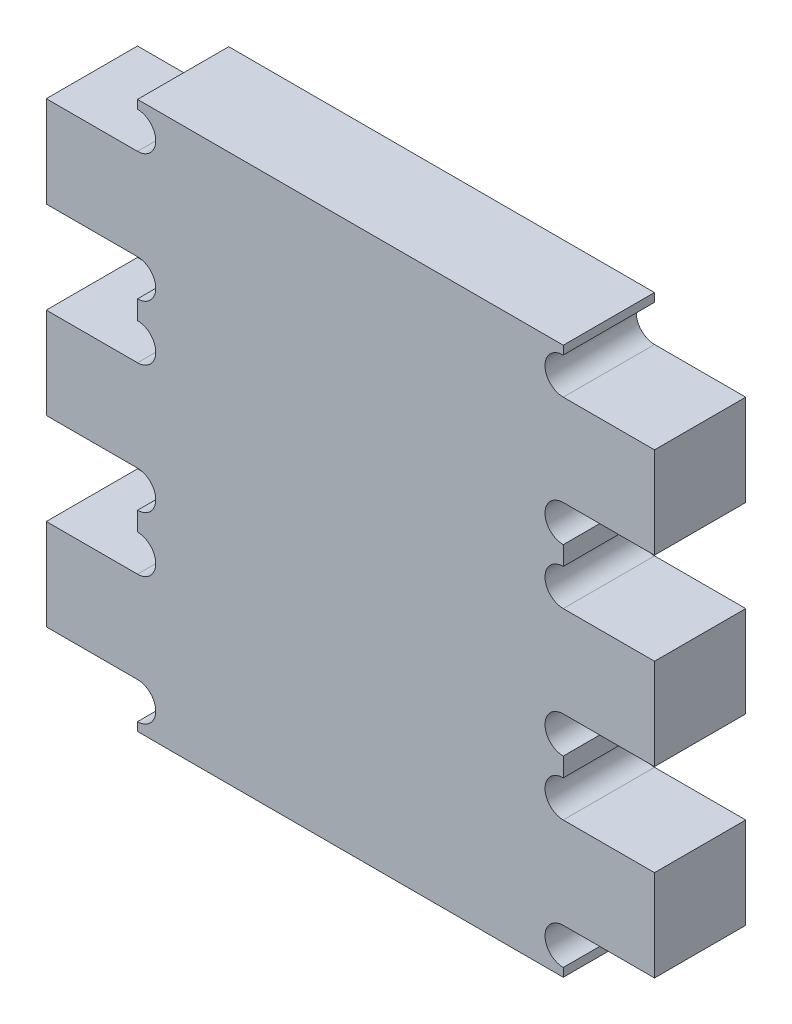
ISO-10303-21;
HEADER;
FILE_DESCRIPTION(('STEP AP214'),'2;1');
FILE_NAME('part.step','',(''),(''),'','','');
FILE_SCHEMA(('AUTOMOTIVE_DESIGN { 1 0 10303 214 1 1 1 1 }'));
ENDSEC;
DATA;
#1=APPLICATION_CONTEXT('core data for automotive mechanical design processes');
#2=APPLICATION_PROTOCOL_DEFINITION('international standard','automotive_design',2000,#1);
#3=PRODUCT_CONTEXT('',#1,'mechanical');
#4=PRODUCT('Part','Part','',(#3));
#5=PRODUCT_RELATED_PRODUCT_CATEGORY('part','',(#4));
#6=PRODUCT_DEFINITION_FORMATION('','',#4);
#7=PRODUCT_DEFINITION_CONTEXT('part definition',#1,'design');
#8=PRODUCT_DEFINITION('design','',#6,#7);
#9=PRODUCT_DEFINITION_SHAPE('','',#8);
#10=(LENGTH_UNIT() NAMED_UNIT(*) SI_UNIT(.MILLI.,.METRE.));
#11=(NAMED_UNIT(*) PLANE_ANGLE_UNIT() SI_UNIT($,.RADIAN.));
#12=(NAMED_UNIT(*) SI_UNIT($,.STERADIAN.) SOLID_ANGLE_UNIT());
#13=UNCERTAINTY_MEASURE_WITH_UNIT(LENGTH_MEASURE(1.E-05),#10,'distance_accuracy_value','');
#14=(GEOMETRIC_REPRESENTATION_CONTEXT(3) GLOBAL_UNCERTAINTY_ASSIGNED_CONTEXT((#13)) GLOBAL_UNIT_ASSIGNED_CONTEXT((#10,
#11,#12)) REPRESENTATION_CONTEXT('',''));
#15=CARTESIAN_POINT('',(0.,0.,0.));
#16=DIRECTION('',(0.,0.,1.));
#17=DIRECTION('',(1.,0.,0.));
#18=AXIS2_PLACEMENT_3D('',#15,#16,#17);
#19=CARTESIAN_POINT('',(15.,85.6,15.));
#20=DIRECTION('',(0.,0.,-1.));
#21=DIRECTION('',(-1.,0.,0.));
#22=AXIS2_PLACEMENT_3D('',#19,#20,#21);
#23=CYLINDRICAL_SURFACE('',#22,3.);
#24=CARTESIAN_POINT('',(15.,85.6,0.));
#25=DIRECTION('',(0.,0.,-1.));
#26=DIRECTION('',(-1.,0.,0.));
#27=AXIS2_PLACEMENT_3D('',#24,#25,#26);
#28=CIRCLE('',#27,3.);
#29=CARTESIAN_POINT('',(15.,88.6,0.));
#30=VERTEX_POINT('',#29);
#31=CARTESIAN_POINT('',(15.,82.6,0.));
#32=VERTEX_POINT('',#31);
#33=EDGE_CURVE('E322',#30,#32,#28,.T.);
#34=ORIENTED_EDGE('',*,*,#33,.T.);
#35=DIRECTION('',(0.,0.,-1.));
#36=VECTOR('',#35,1.);
#37=CARTESIAN_POINT('',(15.,82.6,15.));
#38=LINE('',#37,#36);
#39=CARTESIAN_POINT('',(15.,82.6,15.));
#40=VERTEX_POINT('',#39);
#41=EDGE_CURVE('E11',#40,#32,#38,.T.);
#42=ORIENTED_EDGE('',*,*,#41,.F.);
#43=CARTESIAN_POINT('',(15.,85.6,15.));
#44=DIRECTION('',(0.,0.,-1.));
#45=DIRECTION('',(-1.,0.,0.));
#46=AXIS2_PLACEMENT_3D('',#43,#44,#45);
#47=CIRCLE('',#46,3.);
#48=CARTESIAN_POINT('',(15.,88.6,15.));
#49=VERTEX_POINT('',#48);
#50=EDGE_CURVE('E400',#49,#40,#47,.T.);
#51=ORIENTED_EDGE('',*,*,#50,.F.);
#52=DIRECTION('',(0.,0.,-1.));
#53=VECTOR('',#52,1.);
#54=CARTESIAN_POINT('',(15.,88.6,15.));
#55=LINE('',#54,#53);
#56=EDGE_CURVE('E318',#49,#30,#55,.T.);
#57=ORIENTED_EDGE('',*,*,#56,.T.);
#58=EDGE_LOOP('',(#34,#42,#51,#57));
#59=FACE_BOUND('',#58,.T.);
#60=ADVANCED_FACE('F34',(#59),#23,.F.);
#61=CARTESIAN_POINT('',(15.,82.6,15.));
#62=DIRECTION('',(0.,-1.,0.));
#63=DIRECTION('',(0.,0.,-1.));
#64=AXIS2_PLACEMENT_3D('',#61,#62,#63);
#65=PLANE('',#64);
#66=DIRECTION('',(-1.,0.,0.));
#67=VECTOR('',#66,1.);
#68=CARTESIAN_POINT('',(15.,82.6,0.));
#69=LINE('',#68,#67);
#70=CARTESIAN_POINT('',(0.,82.6,0.));
#71=VERTEX_POINT('',#70);
#72=EDGE_CURVE('E325',#32,#71,#69,.T.);
#73=ORIENTED_EDGE('',*,*,#72,.T.);
#74=DIRECTION('',(0.,0.,-1.));
#75=VECTOR('',#74,1.);
#76=CARTESIAN_POINT('',(0.,82.6,15.));
#77=LINE('',#76,#75);
#78=CARTESIAN_POINT('',(0.,82.6,15.));
#79=VERTEX_POINT('',#78);
#80=EDGE_CURVE('E42',#79,#71,#77,.T.);
#81=ORIENTED_EDGE('',*,*,#80,.F.);
#82=DIRECTION('',(-1.,0.,0.));
#83=VECTOR('',#82,1.);
#84=CARTESIAN_POINT('',(15.,82.6,15.));
#85=LINE('',#84,#83);
#86=EDGE_CURVE('E189',#40,#79,#85,.T.);
#87=ORIENTED_EDGE('',*,*,#86,.F.);
#88=ORIENTED_EDGE('',*,*,#41,.T.);
#89=EDGE_LOOP('',(#73,#81,#87,#88));
#90=FACE_BOUND('',#89,.T.);
#91=ADVANCED_FACE('F618',(#90),#65,.F.);
#92=CARTESIAN_POINT('',(0.,82.6,15.));
#93=DIRECTION('',(1.,0.,0.));
#94=DIRECTION('',(0.,0.,-1.));
#95=AXIS2_PLACEMENT_3D('',#92,#93,#94);
#96=PLANE('',#95);
#97=DIRECTION('',(0.,-1.,0.));
#98=VECTOR('',#97,1.);
#99=CARTESIAN_POINT('',(0.,82.6,0.));
#100=LINE('',#99,#98);
#101=CARTESIAN_POINT('',(0.,67.6,0.));
#102=VERTEX_POINT('',#101);
#103=EDGE_CURVE('E327',#71,#102,#100,.T.);
#104=ORIENTED_EDGE('',*,*,#103,.T.);
#105=DIRECTION('',(0.,0.,-1.));
#106=VECTOR('',#105,1.);
#107=CARTESIAN_POINT('',(0.,67.6,15.));
#108=LINE('',#107,#106);
#109=CARTESIAN_POINT('',(0.,67.6,15.));
#110=VERTEX_POINT('',#109);
#111=EDGE_CURVE('E503',#110,#102,#108,.T.);
#112=ORIENTED_EDGE('',*,*,#111,.F.);
#113=DIRECTION('',(0.,-1.,0.));
#114=VECTOR('',#113,1.);
#115=CARTESIAN_POINT('',(0.,82.6,15.));
#116=LINE('',#115,#114);
#117=EDGE_CURVE('E511',#79,#110,#116,.T.);
#118=ORIENTED_EDGE('',*,*,#117,.F.);
#119=ORIENTED_EDGE('',*,*,#80,.T.);
#120=EDGE_LOOP('',(#104,#112,#118,#119));
#121=FACE_BOUND('',#120,.T.);
#122=ADVANCED_FACE('F509',(#121),#96,.F.);
#123=CARTESIAN_POINT('',(0.,67.6,15.));
#124=DIRECTION('',(0.,1.,0.));
#125=DIRECTION('',(0.,0.,1.));
#126=AXIS2_PLACEMENT_3D('',#123,#124,#125);
#127=PLANE('',#126);
#128=DIRECTION('',(1.,0.,0.));
#129=VECTOR('',#128,1.);
#130=CARTESIAN_POINT('',(0.,67.6,0.));
#131=LINE('',#130,#129);
#132=CARTESIAN_POINT('',(15.,67.6,0.));
#133=VERTEX_POINT('',#132);
#134=EDGE_CURVE('E329',#102,#133,#131,.T.);
#135=ORIENTED_EDGE('',*,*,#134,.T.);
#136=DIRECTION('',(0.,0.,-1.));
#137=VECTOR('',#136,1.);
#138=CARTESIAN_POINT('',(15.,67.6,15.));
#139=LINE('',#138,#137);
#140=CARTESIAN_POINT('',(15.,67.6,15.));
#141=VERTEX_POINT('',#140);
#142=EDGE_CURVE('E500',#141,#133,#139,.T.);
#143=ORIENTED_EDGE('',*,*,#142,.F.);
#144=DIRECTION('',(1.,0.,0.));
#145=VECTOR('',#144,1.);
#146=CARTESIAN_POINT('',(0.,67.6,15.));
#147=LINE('',#146,#145);
#148=EDGE_CURVE('E529',#110,#141,#147,.T.);
#149=ORIENTED_EDGE('',*,*,#148,.F.);
#150=ORIENTED_EDGE('',*,*,#111,.T.);
#151=EDGE_LOOP('',(#135,#143,#149,#150));
#152=FACE_BOUND('',#151,.T.);
#153=ADVANCED_FACE('F520',(#152),#127,.F.);
#154=CARTESIAN_POINT('',(15.,64.6,15.));
#155=DIRECTION('',(0.,0.,-1.));
#156=DIRECTION('',(-1.,0.,0.));
#157=AXIS2_PLACEMENT_3D('',#154,#155,#156);
#158=CYLINDRICAL_SURFACE('',#157,3.);
#159=CARTESIAN_POINT('',(15.,64.6,0.));
#160=DIRECTION('',(0.,0.,-1.));
#161=DIRECTION('',(-1.,0.,0.));
#162=AXIS2_PLACEMENT_3D('',#159,#160,#161);
#163=CIRCLE('',#162,3.);
#164=CARTESIAN_POINT('',(15.,61.6,0.));
#165=VERTEX_POINT('',#164);
#166=EDGE_CURVE('E331',#133,#165,#163,.T.);
#167=ORIENTED_EDGE('',*,*,#166,.T.);
#168=DIRECTION('',(0.,0.,-1.));
#169=VECTOR('',#168,1.);
#170=CARTESIAN_POINT('',(15.,61.6,15.));
#171=LINE('',#170,#169);
#172=CARTESIAN_POINT('',(15.,61.6,15.));
#173=VERTEX_POINT('',#172);
#174=EDGE_CURVE('E497',#173,#165,#171,.T.);
#175=ORIENTED_EDGE('',*,*,#174,.F.);
#176=CARTESIAN_POINT('',(15.,64.6,15.));
#177=DIRECTION('',(0.,0.,-1.));
#178=DIRECTION('',(-1.,0.,0.));
#179=AXIS2_PLACEMENT_3D('',#176,#177,#178);
#180=CIRCLE('',#179,3.);
#181=EDGE_CURVE('E526',#141,#173,#180,.T.);
#182=ORIENTED_EDGE('',*,*,#181,.F.);
#183=ORIENTED_EDGE('',*,*,#142,.T.);
#184=EDGE_LOOP('',(#167,#175,#182,#183));
#185=FACE_BOUND('',#184,.T.);
#186=ADVANCED_FACE('F524',(#185),#158,.F.);
#187=CARTESIAN_POINT('',(15.,61.6,15.));
#188=DIRECTION('',(1.,0.,0.));
#189=DIRECTION('',(0.,0.,-1.));
#190=AXIS2_PLACEMENT_3D('',#187,#188,#189);
#191=PLANE('',#190);
#192=DIRECTION('',(0.,-1.,0.));
#193=VECTOR('',#192,1.);
#194=CARTESIAN_POINT('',(15.,61.6,0.));
#195=LINE('',#194,#193);
#196=CARTESIAN_POINT('',(15.,58.5,0.));
#197=VERTEX_POINT('',#196);
#198=EDGE_CURVE('E333',#165,#197,#195,.T.);
#199=ORIENTED_EDGE('',*,*,#198,.T.);
#200=DIRECTION('',(0.,0.,-1.));
#201=VECTOR('',#200,1.);
#202=CARTESIAN_POINT('',(15.,58.5,15.));
#203=LINE('',#202,#201);
#204=CARTESIAN_POINT('',(15.,58.5,15.));
#205=VERTEX_POINT('',#204);
#206=EDGE_CURVE('E494',#205,#197,#203,.T.);
#207=ORIENTED_EDGE('',*,*,#206,.F.);
#208=DIRECTION('',(0.,-1.,0.));
#209=VECTOR('',#208,1.);
#210=CARTESIAN_POINT('',(15.,61.6,15.));
#211=LINE('',#210,#209);
#212=EDGE_CURVE('E528',#173,#205,#211,.T.);
#213=ORIENTED_EDGE('',*,*,#212,.F.);
#214=ORIENTED_EDGE('',*,*,#174,.T.);
#215=EDGE_LOOP('',(#199,#207,#213,#214));
#216=FACE_BOUND('',#215,.T.);
#217=ADVANCED_FACE('F631',(#216),#191,.F.);
#218=CARTESIAN_POINT('',(15.,55.5,15.));
#219=DIRECTION('',(0.,0.,-1.));
#220=DIRECTION('',(-1.,0.,0.));
#221=AXIS2_PLACEMENT_3D('',#218,#219,#220);
#222=CYLINDRICAL_SURFACE('',#221,3.);
#223=CARTESIAN_POINT('',(15.,55.5,0.));
#224=DIRECTION('',(0.,0.,-1.));
#225=DIRECTION('',(-1.,0.,0.));
#226=AXIS2_PLACEMENT_3D('',#223,#224,#225);
#227=CIRCLE('',#226,3.);
#228=CARTESIAN_POINT('',(15.,52.5,0.));
#229=VERTEX_POINT('',#228);
#230=EDGE_CURVE('E335',#197,#229,#227,.T.);
#231=ORIENTED_EDGE('',*,*,#230,.T.);
#232=DIRECTION('',(0.,0.,-1.));
#233=VECTOR('',#232,1.);
#234=CARTESIAN_POINT('',(15.,52.5,15.));
#235=LINE('',#234,#233);
#236=CARTESIAN_POINT('',(15.,52.5,15.));
#237=VERTEX_POINT('',#236);
#238=EDGE_CURVE('E491',#237,#229,#235,.T.);
#239=ORIENTED_EDGE('',*,*,#238,.F.);
#240=CARTESIAN_POINT('',(15.,55.5,15.));
#241=DIRECTION('',(0.,0.,-1.));
#242=DIRECTION('',(-1.,0.,0.));
#243=AXIS2_PLACEMENT_3D('',#240,#241,#242);
#244=CIRCLE('',#243,3.);
#245=EDGE_CURVE('E531',#205,#237,#244,.T.);
#246=ORIENTED_EDGE('',*,*,#245,.F.);
#247=ORIENTED_EDGE('',*,*,#206,.T.);
#248=EDGE_LOOP('',(#231,#239,#246,#247));
#249=FACE_BOUND('',#248,.T.);
#250=ADVANCED_FACE('F634',(#249),#222,.F.);
#251=CARTESIAN_POINT('',(15.,52.5,15.));
#252=DIRECTION('',(0.,-1.,0.));
#253=DIRECTION('',(0.,0.,-1.));
#254=AXIS2_PLACEMENT_3D('',#251,#252,#253);
#255=PLANE('',#254);
#256=DIRECTION('',(-1.,0.,0.));
#257=VECTOR('',#256,1.);
#258=CARTESIAN_POINT('',(15.,52.5,0.));
#259=LINE('',#258,#257);
#260=CARTESIAN_POINT('',(0.,52.5,0.));
#261=VERTEX_POINT('',#260);
#262=EDGE_CURVE('E337',#229,#261,#259,.T.);
#263=ORIENTED_EDGE('',*,*,#262,.T.);
#264=DIRECTION('',(0.,0.,-1.));
#265=VECTOR('',#264,1.);
#266=CARTESIAN_POINT('',(0.,52.5,15.));
#267=LINE('',#266,#265);
#268=CARTESIAN_POINT('',(0.,52.5,15.));
#269=VERTEX_POINT('',#268);
#270=EDGE_CURVE('E488',#269,#261,#267,.T.);
#271=ORIENTED_EDGE('',*,*,#270,.F.);
#272=DIRECTION('',(-1.,0.,0.));
#273=VECTOR('',#272,1.);
#274=CARTESIAN_POINT('',(15.,52.5,15.));
#275=LINE('',#274,#273);
#276=EDGE_CURVE('E537',#237,#269,#275,.T.);
#277=ORIENTED_EDGE('',*,*,#276,.F.);
#278=ORIENTED_EDGE('',*,*,#238,.T.);
#279=EDGE_LOOP('',(#263,#271,#277,#278));
#280=FACE_BOUND('',#279,.T.);
#281=ADVANCED_FACE('F638',(#280),#255,.F.);
#282=CARTESIAN_POINT('',(0.,52.5,15.));
#283=DIRECTION('',(1.,0.,0.));
#284=DIRECTION('',(0.,0.,-1.));
#285=AXIS2_PLACEMENT_3D('',#282,#283,#284);
#286=PLANE('',#285);
#287=DIRECTION('',(0.,-1.,0.));
#288=VECTOR('',#287,1.);
#289=CARTESIAN_POINT('',(0.,52.5,0.));
#290=LINE('',#289,#288);
#291=CARTESIAN_POINT('',(0.,37.5,0.));
#292=VERTEX_POINT('',#291);
#293=EDGE_CURVE('E339',#261,#292,#290,.T.);
#294=ORIENTED_EDGE('',*,*,#293,.T.);
#295=DIRECTION('',(0.,0.,-1.));
#296=VECTOR('',#295,1.);
#297=CARTESIAN_POINT('',(0.,37.5,15.));
#298=LINE('',#297,#296);
#299=CARTESIAN_POINT('',(0.,37.5,15.));
#300=VERTEX_POINT('',#299);
#301=EDGE_CURVE('E485',#300,#292,#298,.T.);
#302=ORIENTED_EDGE('',*,*,#301,.F.);
#303=DIRECTION('',(0.,-1.,0.));
#304=VECTOR('',#303,1.);
#305=CARTESIAN_POINT('',(0.,52.5,15.));
#306=LINE('',#305,#304);
#307=EDGE_CURVE('E539',#269,#300,#306,.T.);
#308=ORIENTED_EDGE('',*,*,#307,.F.);
#309=ORIENTED_EDGE('',*,*,#270,.T.);
#310=EDGE_LOOP('',(#294,#302,#308,#309));
#311=FACE_BOUND('',#310,.T.);
#312=ADVANCED_FACE('F642',(#311),#286,.F.);
#313=CARTESIAN_POINT('',(0.,37.5,15.));
#314=DIRECTION('',(0.,1.,0.));
#315=DIRECTION('',(0.,0.,1.));
#316=AXIS2_PLACEMENT_3D('',#313,#314,#315);
#317=PLANE('',#316);
#318=DIRECTION('',(1.,0.,0.));
#319=VECTOR('',#318,1.);
#320=CARTESIAN_POINT('',(0.,37.5,0.));
#321=LINE('',#320,#319);
#322=CARTESIAN_POINT('',(15.,37.5,0.));
#323=VERTEX_POINT('',#322);
#324=EDGE_CURVE('E341',#292,#323,#321,.T.);
#325=ORIENTED_EDGE('',*,*,#324,.T.);
#326=DIRECTION('',(0.,0.,-1.));
#327=VECTOR('',#326,1.);
#328=CARTESIAN_POINT('',(15.,37.5,15.));
#329=LINE('',#328,#327);
#330=CARTESIAN_POINT('',(15.,37.5,15.));
#331=VERTEX_POINT('',#330);
#332=EDGE_CURVE('E482',#331,#323,#329,.T.);
#333=ORIENTED_EDGE('',*,*,#332,.F.);
#334=DIRECTION('',(1.,0.,0.));
#335=VECTOR('',#334,1.);
#336=CARTESIAN_POINT('',(0.,37.5,15.));
#337=LINE('',#336,#335);
#338=EDGE_CURVE('E541',#300,#331,#337,.T.);
#339=ORIENTED_EDGE('',*,*,#338,.F.);
#340=ORIENTED_EDGE('',*,*,#301,.T.);
#341=EDGE_LOOP('',(#325,#333,#339,#340));
#342=FACE_BOUND('',#341,.T.);
#343=ADVANCED_FACE('F646',(#342),#317,.F.);
#344=CARTESIAN_POINT('',(15.,34.5,15.));
#345=DIRECTION('',(0.,0.,-1.));
#346=DIRECTION('',(-1.,0.,0.));
#347=AXIS2_PLACEMENT_3D('',#344,#345,#346);
#348=CYLINDRICAL_SURFACE('',#347,3.);
#349=CARTESIAN_POINT('',(15.,34.5,0.));
#350=DIRECTION('',(0.,0.,-1.));
#351=DIRECTION('',(-1.,0.,0.));
#352=AXIS2_PLACEMENT_3D('',#349,#350,#351);
#353=CIRCLE('',#352,3.);
#354=CARTESIAN_POINT('',(15.,31.5,0.));
#355=VERTEX_POINT('',#354);
#356=EDGE_CURVE('E343',#323,#355,#353,.T.);
#357=ORIENTED_EDGE('',*,*,#356,.T.);
#358=DIRECTION('',(0.,0.,-1.));
#359=VECTOR('',#358,1.);
#360=CARTESIAN_POINT('',(15.,31.5,15.));
#361=LINE('',#360,#359);
#362=CARTESIAN_POINT('',(15.,31.5,15.));
#363=VERTEX_POINT('',#362);
#364=EDGE_CURVE('E479',#363,#355,#361,.T.);
#365=ORIENTED_EDGE('',*,*,#364,.F.);
#366=CARTESIAN_POINT('',(15.,34.5,15.));
#367=DIRECTION('',(0.,0.,-1.));
#368=DIRECTION('',(-1.,0.,0.));
#369=AXIS2_PLACEMENT_3D('',#366,#367,#368);
#370=CIRCLE('',#369,3.);
#371=EDGE_CURVE('E543',#331,#363,#370,.T.);
#372=ORIENTED_EDGE('',*,*,#371,.F.);
#373=ORIENTED_EDGE('',*,*,#332,.T.);
#374=EDGE_LOOP('',(#357,#365,#372,#373));
#375=FACE_BOUND('',#374,.T.);
#376=ADVANCED_FACE('F650',(#375),#348,.F.);
#377=CARTESIAN_POINT('',(15.,31.5,15.));
#378=DIRECTION('',(1.,0.,0.));
#379=DIRECTION('',(0.,1.,0.));
#380=AXIS2_PLACEMENT_3D('',#377,#378,#379);
#381=PLANE('',#380);
#382=DIRECTION('',(0.,-1.,0.));
#383=VECTOR('',#382,1.);
#384=CARTESIAN_POINT('',(15.,31.5,0.));
#385=LINE('',#384,#383);
#386=CARTESIAN_POINT('',(15.,28.4,0.));
#387=VERTEX_POINT('',#386);
#388=EDGE_CURVE('E345',#355,#387,#385,.T.);
#389=ORIENTED_EDGE('',*,*,#388,.T.);
#390=DIRECTION('',(0.,0.,-1.));
#391=VECTOR('',#390,1.);
#392=CARTESIAN_POINT('',(15.,28.4,15.));
#393=LINE('',#392,#391);
#394=CARTESIAN_POINT('',(15.,28.4,15.));
#395=VERTEX_POINT('',#394);
#396=EDGE_CURVE('E476',#395,#387,#393,.T.);
#397=ORIENTED_EDGE('',*,*,#396,.F.);
#398=DIRECTION('',(0.,-1.,0.));
#399=VECTOR('',#398,1.);
#400=CARTESIAN_POINT('',(15.,31.5,15.));
#401=LINE('',#400,#399);
#402=EDGE_CURVE('E545',#363,#395,#401,.T.);
#403=ORIENTED_EDGE('',*,*,#402,.F.);
#404=ORIENTED_EDGE('',*,*,#364,.T.);
#405=EDGE_LOOP('',(#389,#397,#403,#404));
#406=FACE_BOUND('',#405,.T.);
#407=ADVANCED_FACE('F654',(#406),#381,.F.);
#408=CARTESIAN_POINT('',(15.,25.4,15.));
#409=DIRECTION('',(0.,0.,-1.));
#410=DIRECTION('',(-1.,0.,0.));
#411=AXIS2_PLACEMENT_3D('',#408,#409,#410);
#412=CYLINDRICAL_SURFACE('',#411,3.);
#413=CARTESIAN_POINT('',(15.,25.4,0.));
#414=DIRECTION('',(0.,0.,-1.));
#415=DIRECTION('',(-1.,0.,0.));
#416=AXIS2_PLACEMENT_3D('',#413,#414,#415);
#417=CIRCLE('',#416,3.);
#418=CARTESIAN_POINT('',(15.,22.4,0.));
#419=VERTEX_POINT('',#418);
#420=EDGE_CURVE('E347',#387,#419,#417,.T.);
#421=ORIENTED_EDGE('',*,*,#420,.T.);
#422=DIRECTION('',(0.,0.,-1.));
#423=VECTOR('',#422,1.);
#424=CARTESIAN_POINT('',(15.,22.4,15.));
#425=LINE('',#424,#423);
#426=CARTESIAN_POINT('',(15.,22.4,15.));
#427=VERTEX_POINT('',#426);
#428=EDGE_CURVE('E473',#427,#419,#425,.T.);
#429=ORIENTED_EDGE('',*,*,#428,.F.);
#430=CARTESIAN_POINT('',(15.,25.4,15.));
#431=DIRECTION('',(0.,0.,-1.));
#432=DIRECTION('',(-1.,0.,0.));
#433=AXIS2_PLACEMENT_3D('',#430,#431,#432);
#434=CIRCLE('',#433,3.);
#435=EDGE_CURVE('E547',#395,#427,#434,.T.);
#436=ORIENTED_EDGE('',*,*,#435,.F.);
#437=ORIENTED_EDGE('',*,*,#396,.T.);
#438=EDGE_LOOP('',(#421,#429,#436,#437));
#439=FACE_BOUND('',#438,.T.);
#440=ADVANCED_FACE('F658',(#439),#412,.F.);
#441=CARTESIAN_POINT('',(15.,22.4,15.));
#442=DIRECTION('',(0.,-1.,0.));
#443=DIRECTION('',(1.,0.,0.));
#444=AXIS2_PLACEMENT_3D('',#441,#442,#443);
#445=PLANE('',#444);
#446=DIRECTION('',(-1.,0.,0.));
#447=VECTOR('',#446,1.);
#448=CARTESIAN_POINT('',(15.,22.4,0.));
#449=LINE('',#448,#447);
#450=CARTESIAN_POINT('',(0.,22.4,0.));
#451=VERTEX_POINT('',#450);
#452=EDGE_CURVE('E349',#419,#451,#449,.T.);
#453=ORIENTED_EDGE('',*,*,#452,.T.);
#454=DIRECTION('',(0.,0.,-1.));
#455=VECTOR('',#454,1.);
#456=CARTESIAN_POINT('',(0.,22.4,15.));
#457=LINE('',#456,#455);
#458=CARTESIAN_POINT('',(0.,22.4,15.));
#459=VERTEX_POINT('',#458);
#460=EDGE_CURVE('E470',#459,#451,#457,.T.);
#461=ORIENTED_EDGE('',*,*,#460,.F.);
#462=DIRECTION('',(-1.,0.,0.));
#463=VECTOR('',#462,1.);
#464=CARTESIAN_POINT('',(15.,22.4,15.));
#465=LINE('',#464,#463);
#466=EDGE_CURVE('E549',#427,#459,#465,.T.);
#467=ORIENTED_EDGE('',*,*,#466,.F.);
#468=ORIENTED_EDGE('',*,*,#428,.T.);
#469=EDGE_LOOP('',(#453,#461,#467,#468));
#470=FACE_BOUND('',#469,.T.);
#471=ADVANCED_FACE('F662',(#470),#445,.F.);
#472=CARTESIAN_POINT('',(0.,22.4,15.));
#473=DIRECTION('',(1.,0.,0.));
#474=DIRECTION('',(0.,0.,-1.));
#475=AXIS2_PLACEMENT_3D('',#472,#473,#474);
#476=PLANE('',#475);
#477=DIRECTION('',(0.,-1.,0.));
#478=VECTOR('',#477,1.);
#479=CARTESIAN_POINT('',(0.,22.4,0.));
#480=LINE('',#479,#478);
#481=CARTESIAN_POINT('',(0.,7.4,0.));
#482=VERTEX_POINT('',#481);
#483=EDGE_CURVE('E351',#451,#482,#480,.T.);
#484=ORIENTED_EDGE('',*,*,#483,.T.);
#485=DIRECTION('',(0.,0.,-1.));
#486=VECTOR('',#485,1.);
#487=CARTESIAN_POINT('',(0.,7.4,15.));
#488=LINE('',#487,#486);
#489=CARTESIAN_POINT('',(0.,7.4,15.));
#490=VERTEX_POINT('',#489);
#491=EDGE_CURVE('E467',#490,#482,#488,.T.);
#492=ORIENTED_EDGE('',*,*,#491,.F.);
#493=DIRECTION('',(0.,-1.,0.));
#494=VECTOR('',#493,1.);
#495=CARTESIAN_POINT('',(0.,22.4,15.));
#496=LINE('',#495,#494);
#497=EDGE_CURVE('E551',#459,#490,#496,.T.);
#498=ORIENTED_EDGE('',*,*,#497,.F.);
#499=ORIENTED_EDGE('',*,*,#460,.T.);
#500=EDGE_LOOP('',(#484,#492,#498,#499));
#501=FACE_BOUND('',#500,.T.);
#502=ADVANCED_FACE('F666',(#501),#476,.F.);
#503=CARTESIAN_POINT('',(0.,7.4,15.));
#504=DIRECTION('',(0.,1.,0.));
#505=DIRECTION('',(0.,0.,1.));
#506=AXIS2_PLACEMENT_3D('',#503,#504,#505);
#507=PLANE('',#506);
#508=DIRECTION('',(1.,0.,0.));
#509=VECTOR('',#508,1.);
#510=CARTESIAN_POINT('',(0.,7.4,0.));
#511=LINE('',#510,#509);
#512=CARTESIAN_POINT('',(15.,7.4,0.));
#513=VERTEX_POINT('',#512);
#514=EDGE_CURVE('E353',#482,#513,#511,.T.);
#515=ORIENTED_EDGE('',*,*,#514,.T.);
#516=DIRECTION('',(0.,0.,-1.));
#517=VECTOR('',#516,1.);
#518=CARTESIAN_POINT('',(15.,7.4,15.));
#519=LINE('',#518,#517);
#520=CARTESIAN_POINT('',(15.,7.4,15.));
#521=VERTEX_POINT('',#520);
#522=EDGE_CURVE('E464',#521,#513,#519,.T.);
#523=ORIENTED_EDGE('',*,*,#522,.F.);
#524=DIRECTION('',(1.,0.,0.));
#525=VECTOR('',#524,1.);
#526=CARTESIAN_POINT('',(0.,7.4,15.));
#527=LINE('',#526,#525);
#528=EDGE_CURVE('E553',#490,#521,#527,.T.);
#529=ORIENTED_EDGE('',*,*,#528,.F.);
#530=ORIENTED_EDGE('',*,*,#491,.T.);
#531=EDGE_LOOP('',(#515,#523,#529,#530));
#532=FACE_BOUND('',#531,.T.);
#533=ADVANCED_FACE('F670',(#532),#507,.F.);
#534=CARTESIAN_POINT('',(15.,4.4,15.));
#535=DIRECTION('',(0.,0.,-1.));
#536=DIRECTION('',(-1.,0.,0.));
#537=AXIS2_PLACEMENT_3D('',#534,#535,#536);
#538=CYLINDRICAL_SURFACE('',#537,3.);
#539=CARTESIAN_POINT('',(15.,4.4,0.));
#540=DIRECTION('',(0.,0.,-1.));
#541=DIRECTION('',(-1.,0.,0.));
#542=AXIS2_PLACEMENT_3D('',#539,#540,#541);
#543=CIRCLE('',#542,3.);
#544=CARTESIAN_POINT('',(15.,1.4,0.));
#545=VERTEX_POINT('',#544);
#546=EDGE_CURVE('E355',#513,#545,#543,.T.);
#547=ORIENTED_EDGE('',*,*,#546,.T.);
#548=DIRECTION('',(0.,0.,-1.));
#549=VECTOR('',#548,1.);
#550=CARTESIAN_POINT('',(15.,1.4,15.));
#551=LINE('',#550,#549);
#552=CARTESIAN_POINT('',(15.,1.4,15.));
#553=VERTEX_POINT('',#552);
#554=EDGE_CURVE('E461',#553,#545,#551,.T.);
#555=ORIENTED_EDGE('',*,*,#554,.F.);
#556=CARTESIAN_POINT('',(15.,4.4,15.));
#557=DIRECTION('',(0.,0.,-1.));
#558=DIRECTION('',(-1.,0.,0.));
#559=AXIS2_PLACEMENT_3D('',#556,#557,#558);
#560=CIRCLE('',#559,3.);
#561=EDGE_CURVE('E555',#521,#553,#560,.T.);
#562=ORIENTED_EDGE('',*,*,#561,.F.);
#563=ORIENTED_EDGE('',*,*,#522,.T.);
#564=EDGE_LOOP('',(#547,#555,#562,#563));
#565=FACE_BOUND('',#564,.T.);
#566=ADVANCED_FACE('F674',(#565),#538,.F.);
#567=CARTESIAN_POINT('',(15.,1.4,15.));
#568=DIRECTION('',(1.,0.,0.));
#569=DIRECTION('',(0.,1.,0.));
#570=AXIS2_PLACEMENT_3D('',#567,#568,#569);
#571=PLANE('',#570);
#572=DIRECTION('',(0.,-1.,0.));
#573=VECTOR('',#572,1.);
#574=CARTESIAN_POINT('',(15.,1.4,0.));
#575=LINE('',#574,#573);
#576=CARTESIAN_POINT('',(15.,0.,0.));
#577=VERTEX_POINT('',#576);
#578=EDGE_CURVE('E357',#545,#577,#575,.T.);
#579=ORIENTED_EDGE('',*,*,#578,.T.);
#580=DIRECTION('',(0.,0.,-1.));
#581=VECTOR('',#580,1.);
#582=CARTESIAN_POINT('',(15.,0.,15.));
#583=LINE('',#582,#581);
#584=CARTESIAN_POINT('',(15.,0.,15.));
#585=VERTEX_POINT('',#584);
#586=EDGE_CURVE('E458',#585,#577,#583,.T.);
#587=ORIENTED_EDGE('',*,*,#586,.F.);
#588=DIRECTION('',(0.,-1.,0.));
#589=VECTOR('',#588,1.);
#590=CARTESIAN_POINT('',(15.,1.4,15.));
#591=LINE('',#590,#589);
#592=EDGE_CURVE('E557',#553,#585,#591,.T.);
#593=ORIENTED_EDGE('',*,*,#592,.F.);
#594=ORIENTED_EDGE('',*,*,#554,.T.);
#595=EDGE_LOOP('',(#579,#587,#593,#594));
#596=FACE_BOUND('',#595,.T.);
#597=ADVANCED_FACE('F678',(#596),#571,.F.);
#598=CARTESIAN_POINT('',(85.,0.,15.));
#599=DIRECTION('',(0.,1.,0.));
#600=DIRECTION('',(0.,0.,1.));
#601=AXIS2_PLACEMENT_3D('',#598,#599,#600);
#602=PLANE('',#601);
#603=DIRECTION('',(1.,0.,0.));
#604=VECTOR('',#603,1.);
#605=CARTESIAN_POINT('',(85.,0.,0.));
#606=LINE('',#605,#604);
#607=CARTESIAN_POINT('',(85.,0.,0.));
#608=VERTEX_POINT('',#607);
#609=EDGE_CURVE('E359',#577,#608,#606,.T.);
#610=ORIENTED_EDGE('',*,*,#609,.T.);
#611=DIRECTION('',(0.,0.,-1.));
#612=VECTOR('',#611,1.);
#613=CARTESIAN_POINT('',(85.,0.,15.));
#614=LINE('',#613,#612);
#615=CARTESIAN_POINT('',(85.,0.,15.));
#616=VERTEX_POINT('',#615);
#617=EDGE_CURVE('E455',#616,#608,#614,.T.);
#618=ORIENTED_EDGE('',*,*,#617,.F.);
#619=DIRECTION('',(1.,0.,0.));
#620=VECTOR('',#619,1.);
#621=CARTESIAN_POINT('',(85.,0.,15.));
#622=LINE('',#621,#620);
#623=EDGE_CURVE('E559',#585,#616,#622,.T.);
#624=ORIENTED_EDGE('',*,*,#623,.F.);
#625=ORIENTED_EDGE('',*,*,#586,.T.);
#626=EDGE_LOOP('',(#610,#618,#624,#625));
#627=FACE_BOUND('',#626,.T.);
#628=ADVANCED_FACE('F682',(#627),#602,.F.);
#629=CARTESIAN_POINT('',(85.,1.39999999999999,15.));
#630=DIRECTION('',(-1.,0.,0.));
#631=DIRECTION('',(0.,-1.,0.));
#632=AXIS2_PLACEMENT_3D('',#629,#630,#631);
#633=PLANE('',#632);
#634=DIRECTION('',(0.,1.,0.));
#635=VECTOR('',#634,1.);
#636=CARTESIAN_POINT('',(85.,1.39999999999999,0.));
#637=LINE('',#636,#635);
#638=CARTESIAN_POINT('',(85.,1.39999999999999,0.));
#639=VERTEX_POINT('',#638);
#640=EDGE_CURVE('E361',#608,#639,#637,.T.);
#641=ORIENTED_EDGE('',*,*,#640,.T.);
#642=DIRECTION('',(0.,0.,-1.));
#643=VECTOR('',#642,1.);
#644=CARTESIAN_POINT('',(85.,1.39999999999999,15.));
#645=LINE('',#644,#643);
#646=CARTESIAN_POINT('',(85.,1.39999999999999,15.));
#647=VERTEX_POINT('',#646);
#648=EDGE_CURVE('E452',#647,#639,#645,.T.);
#649=ORIENTED_EDGE('',*,*,#648,.F.);
#650=DIRECTION('',(0.,1.,0.));
#651=VECTOR('',#650,1.);
#652=CARTESIAN_POINT('',(85.,1.39999999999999,15.));
#653=LINE('',#652,#651);
#654=EDGE_CURVE('E561',#616,#647,#653,.T.);
#655=ORIENTED_EDGE('',*,*,#654,.F.);
#656=ORIENTED_EDGE('',*,*,#617,.T.);
#657=EDGE_LOOP('',(#641,#649,#655,#656));
#658=FACE_BOUND('',#657,.T.);
#659=ADVANCED_FACE('F686',(#658),#633,.F.);
#660=CARTESIAN_POINT('',(85.,4.39999999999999,15.));
#661=DIRECTION('',(0.,0.,-1.));
#662=DIRECTION('',(-1.,0.,0.));
#663=AXIS2_PLACEMENT_3D('',#660,#661,#662);
#664=CYLINDRICAL_SURFACE('',#663,3.);
#665=CARTESIAN_POINT('',(85.,4.39999999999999,0.));
#666=DIRECTION('',(0.,0.,-1.));
#667=DIRECTION('',(-1.,0.,0.));
#668=AXIS2_PLACEMENT_3D('',#665,#666,#667);
#669=CIRCLE('',#668,3.);
#670=CARTESIAN_POINT('',(85.,7.4,0.));
#671=VERTEX_POINT('',#670);
#672=EDGE_CURVE('E363',#639,#671,#669,.T.);
#673=ORIENTED_EDGE('',*,*,#672,.T.);
#674=DIRECTION('',(0.,0.,-1.));
#675=VECTOR('',#674,1.);
#676=CARTESIAN_POINT('',(85.,7.4,15.));
#677=LINE('',#676,#675);
#678=CARTESIAN_POINT('',(85.,7.4,15.));
#679=VERTEX_POINT('',#678);
#680=EDGE_CURVE('E449',#679,#671,#677,.T.);
#681=ORIENTED_EDGE('',*,*,#680,.F.);
#682=CARTESIAN_POINT('',(85.,4.39999999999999,15.));
#683=DIRECTION('',(0.,0.,-1.));
#684=DIRECTION('',(-1.,0.,0.));
#685=AXIS2_PLACEMENT_3D('',#682,#683,#684);
#686=CIRCLE('',#685,3.);
#687=EDGE_CURVE('E563',#647,#679,#686,.T.);
#688=ORIENTED_EDGE('',*,*,#687,.F.);
#689=ORIENTED_EDGE('',*,*,#648,.T.);
#690=EDGE_LOOP('',(#673,#681,#688,#689));
#691=FACE_BOUND('',#690,.T.);
#692=ADVANCED_FACE('F690',(#691),#664,.F.);
#693=CARTESIAN_POINT('',(100.,7.4,15.));
#694=DIRECTION('',(0.,1.,0.));
#695=DIRECTION('',(-1.,0.,0.));
#696=AXIS2_PLACEMENT_3D('',#693,#694,#695);
#697=PLANE('',#696);
#698=DIRECTION('',(1.,0.,0.));
#699=VECTOR('',#698,1.);
#700=CARTESIAN_POINT('',(100.,7.4,0.));
#701=LINE('',#700,#699);
#702=CARTESIAN_POINT('',(100.,7.4,0.));
#703=VERTEX_POINT('',#702);
#704=EDGE_CURVE('E365',#671,#703,#701,.T.);
#705=ORIENTED_EDGE('',*,*,#704,.T.);
#706=DIRECTION('',(0.,0.,-1.));
#707=VECTOR('',#706,1.);
#708=CARTESIAN_POINT('',(100.,7.4,15.));
#709=LINE('',#708,#707);
#710=CARTESIAN_POINT('',(100.,7.4,15.));
#711=VERTEX_POINT('',#710);
#712=EDGE_CURVE('E446',#711,#703,#709,.T.);
#713=ORIENTED_EDGE('',*,*,#712,.F.);
#714=DIRECTION('',(1.,0.,0.));
#715=VECTOR('',#714,1.);
#716=CARTESIAN_POINT('',(100.,7.4,15.));
#717=LINE('',#716,#715);
#718=EDGE_CURVE('E565',#679,#711,#717,.T.);
#719=ORIENTED_EDGE('',*,*,#718,.F.);
#720=ORIENTED_EDGE('',*,*,#680,.T.);
#721=EDGE_LOOP('',(#705,#713,#719,#720));
#722=FACE_BOUND('',#721,.T.);
#723=ADVANCED_FACE('F694',(#722),#697,.F.);
#724=CARTESIAN_POINT('',(100.,22.4,15.));
#725=DIRECTION('',(-1.,0.,0.));
#726=DIRECTION('',(0.,0.,1.));
#727=AXIS2_PLACEMENT_3D('',#724,#725,#726);
#728=PLANE('',#727);
#729=DIRECTION('',(0.,1.,0.));
#730=VECTOR('',#729,1.);
#731=CARTESIAN_POINT('',(100.,22.4,0.));
#732=LINE('',#731,#730);
#733=CARTESIAN_POINT('',(100.,22.4,0.));
#734=VERTEX_POINT('',#733);
#735=EDGE_CURVE('E367',#703,#734,#732,.T.);
#736=ORIENTED_EDGE('',*,*,#735,.T.);
#737=DIRECTION('',(0.,0.,-1.));
#738=VECTOR('',#737,1.);
#739=CARTESIAN_POINT('',(100.,22.4,15.));
#740=LINE('',#739,#738);
#741=CARTESIAN_POINT('',(100.,22.4,15.));
#742=VERTEX_POINT('',#741);
#743=EDGE_CURVE('E443',#742,#734,#740,.T.);
#744=ORIENTED_EDGE('',*,*,#743,.F.);
#745=DIRECTION('',(0.,1.,0.));
#746=VECTOR('',#745,1.);
#747=CARTESIAN_POINT('',(100.,22.4,15.));
#748=LINE('',#747,#746);
#749=EDGE_CURVE('E567',#711,#742,#748,.T.);
#750=ORIENTED_EDGE('',*,*,#749,.F.);
#751=ORIENTED_EDGE('',*,*,#712,.T.);
#752=EDGE_LOOP('',(#736,#744,#750,#751));
#753=FACE_BOUND('',#752,.T.);
#754=ADVANCED_FACE('F698',(#753),#728,.F.);
#755=CARTESIAN_POINT('',(85.,22.4,15.));
#756=DIRECTION('',(0.,-1.,0.));
#757=DIRECTION('',(1.,0.,0.));
#758=AXIS2_PLACEMENT_3D('',#755,#756,#757);
#759=PLANE('',#758);
#760=DIRECTION('',(-1.,0.,0.));
#761=VECTOR('',#760,1.);
#762=CARTESIAN_POINT('',(85.,22.4,0.));
#763=LINE('',#762,#761);
#764=CARTESIAN_POINT('',(85.,22.4,0.));
#765=VERTEX_POINT('',#764);
#766=EDGE_CURVE('E369',#734,#765,#763,.T.);
#767=ORIENTED_EDGE('',*,*,#766,.T.);
#768=DIRECTION('',(0.,0.,-1.));
#769=VECTOR('',#768,1.);
#770=CARTESIAN_POINT('',(85.,22.4,15.));
#771=LINE('',#770,#769);
#772=CARTESIAN_POINT('',(85.,22.4,15.));
#773=VERTEX_POINT('',#772);
#774=EDGE_CURVE('E440',#773,#765,#771,.T.);
#775=ORIENTED_EDGE('',*,*,#774,.F.);
#776=DIRECTION('',(-1.,0.,0.));
#777=VECTOR('',#776,1.);
#778=CARTESIAN_POINT('',(85.,22.4,15.));
#779=LINE('',#778,#777);
#780=EDGE_CURVE('E569',#742,#773,#779,.T.);
#781=ORIENTED_EDGE('',*,*,#780,.F.);
#782=ORIENTED_EDGE('',*,*,#743,.T.);
#783=EDGE_LOOP('',(#767,#775,#781,#782));
#784=FACE_BOUND('',#783,.T.);
#785=ADVANCED_FACE('F702',(#784),#759,.F.);
#786=CARTESIAN_POINT('',(85.,25.4,15.));
#787=DIRECTION('',(0.,0.,-1.));
#788=DIRECTION('',(-1.,0.,0.));
#789=AXIS2_PLACEMENT_3D('',#786,#787,#788);
#790=CYLINDRICAL_SURFACE('',#789,3.);
#791=CARTESIAN_POINT('',(85.,25.4,0.));
#792=DIRECTION('',(0.,0.,-1.));
#793=DIRECTION('',(-1.,0.,0.));
#794=AXIS2_PLACEMENT_3D('',#791,#792,#793);
#795=CIRCLE('',#794,3.);
#796=CARTESIAN_POINT('',(85.,28.4,0.));
#797=VERTEX_POINT('',#796);
#798=EDGE_CURVE('E371',#765,#797,#795,.T.);
#799=ORIENTED_EDGE('',*,*,#798,.T.);
#800=DIRECTION('',(0.,0.,-1.));
#801=VECTOR('',#800,1.);
#802=CARTESIAN_POINT('',(85.,28.4,15.));
#803=LINE('',#802,#801);
#804=CARTESIAN_POINT('',(85.,28.4,15.));
#805=VERTEX_POINT('',#804);
#806=EDGE_CURVE('E437',#805,#797,#803,.T.);
#807=ORIENTED_EDGE('',*,*,#806,.F.);
#808=CARTESIAN_POINT('',(85.,25.4,15.));
#809=DIRECTION('',(0.,0.,-1.));
#810=DIRECTION('',(-1.,0.,0.));
#811=AXIS2_PLACEMENT_3D('',#808,#809,#810);
#812=CIRCLE('',#811,3.);
#813=EDGE_CURVE('E571',#773,#805,#812,.T.);
#814=ORIENTED_EDGE('',*,*,#813,.F.);
#815=ORIENTED_EDGE('',*,*,#774,.T.);
#816=EDGE_LOOP('',(#799,#807,#814,#815));
#817=FACE_BOUND('',#816,.T.);
#818=ADVANCED_FACE('F706',(#817),#790,.F.);
#819=CARTESIAN_POINT('',(85.,31.5,15.));
#820=DIRECTION('',(-1.,0.,0.));
#821=DIRECTION('',(0.,-1.,0.));
#822=AXIS2_PLACEMENT_3D('',#819,#820,#821);
#823=PLANE('',#822);
#824=DIRECTION('',(0.,1.,0.));
#825=VECTOR('',#824,1.);
#826=CARTESIAN_POINT('',(85.,31.5,0.));
#827=LINE('',#826,#825);
#828=CARTESIAN_POINT('',(85.,31.5,0.));
#829=VERTEX_POINT('',#828);
#830=EDGE_CURVE('E373',#797,#829,#827,.T.);
#831=ORIENTED_EDGE('',*,*,#830,.T.);
#832=DIRECTION('',(0.,0.,-1.));
#833=VECTOR('',#832,1.);
#834=CARTESIAN_POINT('',(85.,31.5,15.));
#835=LINE('',#834,#833);
#836=CARTESIAN_POINT('',(85.,31.5,15.));
#837=VERTEX_POINT('',#836);
#838=EDGE_CURVE('E434',#837,#829,#835,.T.);
#839=ORIENTED_EDGE('',*,*,#838,.F.);
#840=DIRECTION('',(0.,1.,0.));
#841=VECTOR('',#840,1.);
#842=CARTESIAN_POINT('',(85.,31.5,15.));
#843=LINE('',#842,#841);
#844=EDGE_CURVE('E573',#805,#837,#843,.T.);
#845=ORIENTED_EDGE('',*,*,#844,.F.);
#846=ORIENTED_EDGE('',*,*,#806,.T.);
#847=EDGE_LOOP('',(#831,#839,#845,#846));
#848=FACE_BOUND('',#847,.T.);
#849=ADVANCED_FACE('F710',(#848),#823,.F.);
#850=CARTESIAN_POINT('',(85.,34.5,15.));
#851=DIRECTION('',(0.,0.,-1.));
#852=DIRECTION('',(-1.,0.,0.));
#853=AXIS2_PLACEMENT_3D('',#850,#851,#852);
#854=CYLINDRICAL_SURFACE('',#853,3.);
#855=CARTESIAN_POINT('',(85.,34.5,0.));
#856=DIRECTION('',(0.,0.,-1.));
#857=DIRECTION('',(-1.,0.,0.));
#858=AXIS2_PLACEMENT_3D('',#855,#856,#857);
#859=CIRCLE('',#858,3.);
#860=CARTESIAN_POINT('',(85.,37.5,0.));
#861=VERTEX_POINT('',#860);
#862=EDGE_CURVE('E375',#829,#861,#859,.T.);
#863=ORIENTED_EDGE('',*,*,#862,.T.);
#864=DIRECTION('',(0.,0.,-1.));
#865=VECTOR('',#864,1.);
#866=CARTESIAN_POINT('',(85.,37.5,15.));
#867=LINE('',#866,#865);
#868=CARTESIAN_POINT('',(85.,37.5,15.));
#869=VERTEX_POINT('',#868);
#870=EDGE_CURVE('E431',#869,#861,#867,.T.);
#871=ORIENTED_EDGE('',*,*,#870,.F.);
#872=CARTESIAN_POINT('',(85.,34.5,15.));
#873=DIRECTION('',(0.,0.,-1.));
#874=DIRECTION('',(-1.,0.,0.));
#875=AXIS2_PLACEMENT_3D('',#872,#873,#874);
#876=CIRCLE('',#875,3.);
#877=EDGE_CURVE('E575',#837,#869,#876,.T.);
#878=ORIENTED_EDGE('',*,*,#877,.F.);
#879=ORIENTED_EDGE('',*,*,#838,.T.);
#880=EDGE_LOOP('',(#863,#871,#878,#879));
#881=FACE_BOUND('',#880,.T.);
#882=ADVANCED_FACE('F714',(#881),#854,.F.);
#883=CARTESIAN_POINT('',(100.,37.5,15.));
#884=DIRECTION('',(0.,1.,0.));
#885=DIRECTION('',(-1.,0.,0.));
#886=AXIS2_PLACEMENT_3D('',#883,#884,#885);
#887=PLANE('',#886);
#888=DIRECTION('',(1.,0.,0.));
#889=VECTOR('',#888,1.);
#890=CARTESIAN_POINT('',(100.,37.5,0.));
#891=LINE('',#890,#889);
#892=CARTESIAN_POINT('',(100.,37.5,0.));
#893=VERTEX_POINT('',#892);
#894=EDGE_CURVE('E377',#861,#893,#891,.T.);
#895=ORIENTED_EDGE('',*,*,#894,.T.);
#896=DIRECTION('',(0.,0.,-1.));
#897=VECTOR('',#896,1.);
#898=CARTESIAN_POINT('',(100.,37.5,15.));
#899=LINE('',#898,#897);
#900=CARTESIAN_POINT('',(100.,37.5,15.));
#901=VERTEX_POINT('',#900);
#902=EDGE_CURVE('E428',#901,#893,#899,.T.);
#903=ORIENTED_EDGE('',*,*,#902,.F.);
#904=DIRECTION('',(1.,0.,0.));
#905=VECTOR('',#904,1.);
#906=CARTESIAN_POINT('',(100.,37.5,15.));
#907=LINE('',#906,#905);
#908=EDGE_CURVE('E577',#869,#901,#907,.T.);
#909=ORIENTED_EDGE('',*,*,#908,.F.);
#910=ORIENTED_EDGE('',*,*,#870,.T.);
#911=EDGE_LOOP('',(#895,#903,#909,#910));
#912=FACE_BOUND('',#911,.T.);
#913=ADVANCED_FACE('F718',(#912),#887,.F.);
#914=CARTESIAN_POINT('',(100.,52.5,15.));
#915=DIRECTION('',(-1.,0.,0.));
#916=DIRECTION('',(0.,-1.,0.));
#917=AXIS2_PLACEMENT_3D('',#914,#915,#916);
#918=PLANE('',#917);
#919=DIRECTION('',(0.,1.,0.));
#920=VECTOR('',#919,1.);
#921=CARTESIAN_POINT('',(100.,52.5,0.));
#922=LINE('',#921,#920);
#923=CARTESIAN_POINT('',(100.,52.5,0.));
#924=VERTEX_POINT('',#923);
#925=EDGE_CURVE('E379',#893,#924,#922,.T.);
#926=ORIENTED_EDGE('',*,*,#925,.T.);
#927=DIRECTION('',(0.,0.,-1.));
#928=VECTOR('',#927,1.);
#929=CARTESIAN_POINT('',(100.,52.5,15.));
#930=LINE('',#929,#928);
#931=CARTESIAN_POINT('',(100.,52.5,15.));
#932=VERTEX_POINT('',#931);
#933=EDGE_CURVE('E425',#932,#924,#930,.T.);
#934=ORIENTED_EDGE('',*,*,#933,.F.);
#935=DIRECTION('',(0.,1.,0.));
#936=VECTOR('',#935,1.);
#937=CARTESIAN_POINT('',(100.,52.5,15.));
#938=LINE('',#937,#936);
#939=EDGE_CURVE('E579',#901,#932,#938,.T.);
#940=ORIENTED_EDGE('',*,*,#939,.F.);
#941=ORIENTED_EDGE('',*,*,#902,.T.);
#942=EDGE_LOOP('',(#926,#934,#940,#941));
#943=FACE_BOUND('',#942,.T.);
#944=ADVANCED_FACE('F722',(#943),#918,.F.);
#945=CARTESIAN_POINT('',(85.,52.5,15.));
#946=DIRECTION('',(0.,-1.,0.));
#947=DIRECTION('',(0.,0.,-1.));
#948=AXIS2_PLACEMENT_3D('',#945,#946,#947);
#949=PLANE('',#948);
#950=DIRECTION('',(-1.,0.,0.));
#951=VECTOR('',#950,1.);
#952=CARTESIAN_POINT('',(85.,52.5,0.));
#953=LINE('',#952,#951);
#954=CARTESIAN_POINT('',(85.,52.5,0.));
#955=VERTEX_POINT('',#954);
#956=EDGE_CURVE('E381',#924,#955,#953,.T.);
#957=ORIENTED_EDGE('',*,*,#956,.T.);
#958=DIRECTION('',(0.,0.,-1.));
#959=VECTOR('',#958,1.);
#960=CARTESIAN_POINT('',(85.,52.5,15.));
#961=LINE('',#960,#959);
#962=CARTESIAN_POINT('',(85.,52.5,15.));
#963=VERTEX_POINT('',#962);
#964=EDGE_CURVE('E422',#963,#955,#961,.T.);
#965=ORIENTED_EDGE('',*,*,#964,.F.);
#966=DIRECTION('',(-1.,0.,0.));
#967=VECTOR('',#966,1.);
#968=CARTESIAN_POINT('',(85.,52.5,15.));
#969=LINE('',#968,#967);
#970=EDGE_CURVE('E581',#932,#963,#969,.T.);
#971=ORIENTED_EDGE('',*,*,#970,.F.);
#972=ORIENTED_EDGE('',*,*,#933,.T.);
#973=EDGE_LOOP('',(#957,#965,#971,#972));
#974=FACE_BOUND('',#973,.T.);
#975=ADVANCED_FACE('F726',(#974),#949,.F.);
#976=CARTESIAN_POINT('',(85.,55.5,15.));
#977=DIRECTION('',(0.,0.,-1.));
#978=DIRECTION('',(-1.,0.,0.));
#979=AXIS2_PLACEMENT_3D('',#976,#977,#978);
#980=CYLINDRICAL_SURFACE('',#979,3.);
#981=CARTESIAN_POINT('',(85.,55.5,0.));
#982=DIRECTION('',(0.,0.,-1.));
#983=DIRECTION('',(-1.,0.,0.));
#984=AXIS2_PLACEMENT_3D('',#981,#982,#983);
#985=CIRCLE('',#984,3.);
#986=CARTESIAN_POINT('',(85.,58.5,0.));
#987=VERTEX_POINT('',#986);
#988=EDGE_CURVE('E383',#955,#987,#985,.T.);
#989=ORIENTED_EDGE('',*,*,#988,.T.);
#990=DIRECTION('',(0.,0.,-1.));
#991=VECTOR('',#990,1.);
#992=CARTESIAN_POINT('',(85.,58.5,15.));
#993=LINE('',#992,#991);
#994=CARTESIAN_POINT('',(85.,58.5,15.));
#995=VERTEX_POINT('',#994);
#996=EDGE_CURVE('E419',#995,#987,#993,.T.);
#997=ORIENTED_EDGE('',*,*,#996,.F.);
#998=CARTESIAN_POINT('',(85.,55.5,15.));
#999=DIRECTION('',(0.,0.,-1.));
#1000=DIRECTION('',(-1.,0.,0.));
#1001=AXIS2_PLACEMENT_3D('',#998,#999,#1000);
#1002=CIRCLE('',#1001,3.);
#1003=EDGE_CURVE('E583',#963,#995,#1002,.T.);
#1004=ORIENTED_EDGE('',*,*,#1003,.F.);
#1005=ORIENTED_EDGE('',*,*,#964,.T.);
#1006=EDGE_LOOP('',(#989,#997,#1004,#1005));
#1007=FACE_BOUND('',#1006,.T.);
#1008=ADVANCED_FACE('F730',(#1007),#980,.F.);
#1009=CARTESIAN_POINT('',(85.,61.6,15.));
#1010=DIRECTION('',(-1.,0.,0.));
#1011=DIRECTION('',(0.,-1.,0.));
#1012=AXIS2_PLACEMENT_3D('',#1009,#1010,#1011);
#1013=PLANE('',#1012);
#1014=DIRECTION('',(0.,1.,0.));
#1015=VECTOR('',#1014,1.);
#1016=CARTESIAN_POINT('',(85.,61.6,0.));
#1017=LINE('',#1016,#1015);
#1018=CARTESIAN_POINT('',(85.,61.6,0.));
#1019=VERTEX_POINT('',#1018);
#1020=EDGE_CURVE('E385',#987,#1019,#1017,.T.);
#1021=ORIENTED_EDGE('',*,*,#1020,.T.);
#1022=DIRECTION('',(0.,0.,-1.));
#1023=VECTOR('',#1022,1.);
#1024=CARTESIAN_POINT('',(85.,61.6,15.));
#1025=LINE('',#1024,#1023);
#1026=CARTESIAN_POINT('',(85.,61.6,15.));
#1027=VERTEX_POINT('',#1026);
#1028=EDGE_CURVE('E416',#1027,#1019,#1025,.T.);
#1029=ORIENTED_EDGE('',*,*,#1028,.F.);
#1030=DIRECTION('',(0.,1.,0.));
#1031=VECTOR('',#1030,1.);
#1032=CARTESIAN_POINT('',(85.,61.6,15.));
#1033=LINE('',#1032,#1031);
#1034=EDGE_CURVE('E585',#995,#1027,#1033,.T.);
#1035=ORIENTED_EDGE('',*,*,#1034,.F.);
#1036=ORIENTED_EDGE('',*,*,#996,.T.);
#1037=EDGE_LOOP('',(#1021,#1029,#1035,#1036));
#1038=FACE_BOUND('',#1037,.T.);
#1039=ADVANCED_FACE('F734',(#1038),#1013,.F.);
#1040=CARTESIAN_POINT('',(85.,64.6,15.));
#1041=DIRECTION('',(0.,0.,-1.));
#1042=DIRECTION('',(-1.,0.,0.));
#1043=AXIS2_PLACEMENT_3D('',#1040,#1041,#1042);
#1044=CYLINDRICAL_SURFACE('',#1043,3.);
#1045=CARTESIAN_POINT('',(85.,64.6,0.));
#1046=DIRECTION('',(0.,0.,-1.));
#1047=DIRECTION('',(-1.,0.,0.));
#1048=AXIS2_PLACEMENT_3D('',#1045,#1046,#1047);
#1049=CIRCLE('',#1048,3.);
#1050=CARTESIAN_POINT('',(85.,67.6,0.));
#1051=VERTEX_POINT('',#1050);
#1052=EDGE_CURVE('E387',#1019,#1051,#1049,.T.);
#1053=ORIENTED_EDGE('',*,*,#1052,.T.);
#1054=DIRECTION('',(0.,0.,-1.));
#1055=VECTOR('',#1054,1.);
#1056=CARTESIAN_POINT('',(85.,67.6,15.));
#1057=LINE('',#1056,#1055);
#1058=CARTESIAN_POINT('',(85.,67.6,15.));
#1059=VERTEX_POINT('',#1058);
#1060=EDGE_CURVE('E413',#1059,#1051,#1057,.T.);
#1061=ORIENTED_EDGE('',*,*,#1060,.F.);
#1062=CARTESIAN_POINT('',(85.,64.6,15.));
#1063=DIRECTION('',(0.,0.,-1.));
#1064=DIRECTION('',(-1.,0.,0.));
#1065=AXIS2_PLACEMENT_3D('',#1062,#1063,#1064);
#1066=CIRCLE('',#1065,3.);
#1067=EDGE_CURVE('E587',#1027,#1059,#1066,.T.);
#1068=ORIENTED_EDGE('',*,*,#1067,.F.);
#1069=ORIENTED_EDGE('',*,*,#1028,.T.);
#1070=EDGE_LOOP('',(#1053,#1061,#1068,#1069));
#1071=FACE_BOUND('',#1070,.T.);
#1072=ADVANCED_FACE('F738',(#1071),#1044,.F.);
#1073=CARTESIAN_POINT('',(100.,67.6,15.));
#1074=DIRECTION('',(0.,1.,0.));
#1075=DIRECTION('',(0.,0.,1.));
#1076=AXIS2_PLACEMENT_3D('',#1073,#1074,#1075);
#1077=PLANE('',#1076);
#1078=DIRECTION('',(1.,0.,0.));
#1079=VECTOR('',#1078,1.);
#1080=CARTESIAN_POINT('',(100.,67.6,0.));
#1081=LINE('',#1080,#1079);
#1082=CARTESIAN_POINT('',(100.,67.6,0.));
#1083=VERTEX_POINT('',#1082);
#1084=EDGE_CURVE('E389',#1051,#1083,#1081,.T.);
#1085=ORIENTED_EDGE('',*,*,#1084,.T.);
#1086=DIRECTION('',(0.,0.,-1.));
#1087=VECTOR('',#1086,1.);
#1088=CARTESIAN_POINT('',(100.,67.6,15.));
#1089=LINE('',#1088,#1087);
#1090=CARTESIAN_POINT('',(100.,67.6,15.));
#1091=VERTEX_POINT('',#1090);
#1092=EDGE_CURVE('E410',#1091,#1083,#1089,.T.);
#1093=ORIENTED_EDGE('',*,*,#1092,.F.);
#1094=DIRECTION('',(1.,0.,0.));
#1095=VECTOR('',#1094,1.);
#1096=CARTESIAN_POINT('',(100.,67.6,15.));
#1097=LINE('',#1096,#1095);
#1098=EDGE_CURVE('E589',#1059,#1091,#1097,.T.);
#1099=ORIENTED_EDGE('',*,*,#1098,.F.);
#1100=ORIENTED_EDGE('',*,*,#1060,.T.);
#1101=EDGE_LOOP('',(#1085,#1093,#1099,#1100));
#1102=FACE_BOUND('',#1101,.T.);
#1103=ADVANCED_FACE('F742',(#1102),#1077,.F.);
#1104=CARTESIAN_POINT('',(100.,82.6,15.));
#1105=DIRECTION('',(-1.,0.,0.));
#1106=DIRECTION('',(0.,0.,1.));
#1107=AXIS2_PLACEMENT_3D('',#1104,#1105,#1106);
#1108=PLANE('',#1107);
#1109=DIRECTION('',(0.,1.,0.));
#1110=VECTOR('',#1109,1.);
#1111=CARTESIAN_POINT('',(100.,82.6,0.));
#1112=LINE('',#1111,#1110);
#1113=CARTESIAN_POINT('',(100.,82.6,0.));
#1114=VERTEX_POINT('',#1113);
#1115=EDGE_CURVE('E391',#1083,#1114,#1112,.T.);
#1116=ORIENTED_EDGE('',*,*,#1115,.T.);
#1117=DIRECTION('',(0.,0.,-1.));
#1118=VECTOR('',#1117,1.);
#1119=CARTESIAN_POINT('',(100.,82.6,15.));
#1120=LINE('',#1119,#1118);
#1121=CARTESIAN_POINT('',(100.,82.6,15.));
#1122=VERTEX_POINT('',#1121);
#1123=EDGE_CURVE('E407',#1122,#1114,#1120,.T.);
#1124=ORIENTED_EDGE('',*,*,#1123,.F.);
#1125=DIRECTION('',(0.,1.,0.));
#1126=VECTOR('',#1125,1.);
#1127=CARTESIAN_POINT('',(100.,82.6,15.));
#1128=LINE('',#1127,#1126);
#1129=EDGE_CURVE('E591',#1091,#1122,#1128,.T.);
#1130=ORIENTED_EDGE('',*,*,#1129,.F.);
#1131=ORIENTED_EDGE('',*,*,#1092,.T.);
#1132=EDGE_LOOP('',(#1116,#1124,#1130,#1131));
#1133=FACE_BOUND('',#1132,.T.);
#1134=ADVANCED_FACE('F746',(#1133),#1108,.F.);
#1135=CARTESIAN_POINT('',(85.,82.6,15.));
#1136=DIRECTION('',(0.,-1.,0.));
#1137=DIRECTION('',(0.,0.,-1.));
#1138=AXIS2_PLACEMENT_3D('',#1135,#1136,#1137);
#1139=PLANE('',#1138);
#1140=DIRECTION('',(-1.,0.,0.));
#1141=VECTOR('',#1140,1.);
#1142=CARTESIAN_POINT('',(85.,82.6,0.));
#1143=LINE('',#1142,#1141);
#1144=CARTESIAN_POINT('',(85.,82.6,0.));
#1145=VERTEX_POINT('',#1144);
#1146=EDGE_CURVE('E393',#1114,#1145,#1143,.T.);
#1147=ORIENTED_EDGE('',*,*,#1146,.T.);
#1148=DIRECTION('',(0.,0.,-1.));
#1149=VECTOR('',#1148,1.);
#1150=CARTESIAN_POINT('',(85.,82.6,15.));
#1151=LINE('',#1150,#1149);
#1152=CARTESIAN_POINT('',(85.,82.6,15.));
#1153=VERTEX_POINT('',#1152);
#1154=EDGE_CURVE('E404',#1153,#1145,#1151,.T.);
#1155=ORIENTED_EDGE('',*,*,#1154,.F.);
#1156=DIRECTION('',(-1.,0.,0.));
#1157=VECTOR('',#1156,1.);
#1158=CARTESIAN_POINT('',(85.,82.6,15.));
#1159=LINE('',#1158,#1157);
#1160=EDGE_CURVE('E593',#1122,#1153,#1159,.T.);
#1161=ORIENTED_EDGE('',*,*,#1160,.F.);
#1162=ORIENTED_EDGE('',*,*,#1123,.T.);
#1163=EDGE_LOOP('',(#1147,#1155,#1161,#1162));
#1164=FACE_BOUND('',#1163,.T.);
#1165=ADVANCED_FACE('F599',(#1164),#1139,.F.);
#1166=CARTESIAN_POINT('',(85.,85.6,15.));
#1167=DIRECTION('',(0.,0.,-1.));
#1168=DIRECTION('',(-1.,0.,0.));
#1169=AXIS2_PLACEMENT_3D('',#1166,#1167,#1168);
#1170=CYLINDRICAL_SURFACE('',#1169,3.);
#1171=CARTESIAN_POINT('',(85.,85.6,0.));
#1172=DIRECTION('',(0.,0.,-1.));
#1173=DIRECTION('',(-1.,0.,0.));
#1174=AXIS2_PLACEMENT_3D('',#1171,#1172,#1173);
#1175=CIRCLE('',#1174,3.);
#1176=CARTESIAN_POINT('',(85.,88.6,0.));
#1177=VERTEX_POINT('',#1176);
#1178=EDGE_CURVE('E395',#1145,#1177,#1175,.T.);
#1179=ORIENTED_EDGE('',*,*,#1178,.T.);
#1180=DIRECTION('',(0.,0.,-1.));
#1181=VECTOR('',#1180,1.);
#1182=CARTESIAN_POINT('',(85.,88.6,15.));
#1183=LINE('',#1182,#1181);
#1184=CARTESIAN_POINT('',(85.,88.6,15.));
#1185=VERTEX_POINT('',#1184);
#1186=EDGE_CURVE('E313',#1185,#1177,#1183,.T.);
#1187=ORIENTED_EDGE('',*,*,#1186,.F.);
#1188=CARTESIAN_POINT('',(85.,85.6,15.));
#1189=DIRECTION('',(0.,0.,-1.));
#1190=DIRECTION('',(-1.,0.,0.));
#1191=AXIS2_PLACEMENT_3D('',#1188,#1189,#1190);
#1192=CIRCLE('',#1191,3.);
#1193=EDGE_CURVE('E304',#1153,#1185,#1192,.T.);
#1194=ORIENTED_EDGE('',*,*,#1193,.F.);
#1195=ORIENTED_EDGE('',*,*,#1154,.T.);
#1196=EDGE_LOOP('',(#1179,#1187,#1194,#1195));
#1197=FACE_BOUND('',#1196,.T.);
#1198=ADVANCED_FACE('F603',(#1197),#1170,.F.);
#1199=CARTESIAN_POINT('',(85.,88.6,15.));
#1200=DIRECTION('',(-1.,0.,0.));
#1201=DIRECTION('',(0.,0.,1.));
#1202=AXIS2_PLACEMENT_3D('',#1199,#1200,#1201);
#1203=PLANE('',#1202);
#1204=DIRECTION('',(0.,1.,0.));
#1205=VECTOR('',#1204,1.);
#1206=CARTESIAN_POINT('',(85.,88.6,0.));
#1207=LINE('',#1206,#1205);
#1208=CARTESIAN_POINT('',(85.,90.,0.));
#1209=VERTEX_POINT('',#1208);
#1210=EDGE_CURVE('E312',#1177,#1209,#1207,.T.);
#1211=ORIENTED_EDGE('',*,*,#1210,.T.);
#1212=DIRECTION('',(0.,0.,-1.));
#1213=VECTOR('',#1212,1.);
#1214=CARTESIAN_POINT('',(85.,90.,15.));
#1215=LINE('',#1214,#1213);
#1216=CARTESIAN_POINT('',(85.,90.,15.));
#1217=VERTEX_POINT('',#1216);
#1218=EDGE_CURVE('E309',#1217,#1209,#1215,.T.);
#1219=ORIENTED_EDGE('',*,*,#1218,.F.);
#1220=DIRECTION('',(0.,1.,0.));
#1221=VECTOR('',#1220,1.);
#1222=CARTESIAN_POINT('',(85.,88.6,15.));
#1223=LINE('',#1222,#1221);
#1224=EDGE_CURVE('E298',#1185,#1217,#1223,.T.);
#1225=ORIENTED_EDGE('',*,*,#1224,.F.);
#1226=ORIENTED_EDGE('',*,*,#1186,.T.);
#1227=EDGE_LOOP('',(#1211,#1219,#1225,#1226));
#1228=FACE_BOUND('',#1227,.T.);
#1229=ADVANCED_FACE('F310',(#1228),#1203,.F.);
#1230=CARTESIAN_POINT('',(15.,90.,15.));
#1231=DIRECTION('',(0.,-1.,0.));
#1232=DIRECTION('',(0.,0.,-1.));
#1233=AXIS2_PLACEMENT_3D('',#1230,#1231,#1232);
#1234=PLANE('',#1233);
#1235=DIRECTION('',(-1.,0.,0.));
#1236=VECTOR('',#1235,1.);
#1237=CARTESIAN_POINT('',(15.,90.,0.));
#1238=LINE('',#1237,#1236);
#1239=CARTESIAN_POINT('',(15.,90.,0.));
#1240=VERTEX_POINT('',#1239);
#1241=EDGE_CURVE('E175',#1209,#1240,#1238,.T.);
#1242=ORIENTED_EDGE('',*,*,#1241,.T.);
#1243=DIRECTION('',(0.,0.,-1.));
#1244=VECTOR('',#1243,1.);
#1245=CARTESIAN_POINT('',(15.,90.,15.));
#1246=LINE('',#1245,#1244);
#1247=CARTESIAN_POINT('',(15.,90.,15.));
#1248=VERTEX_POINT('',#1247);
#1249=EDGE_CURVE('E314',#1248,#1240,#1246,.T.);
#1250=ORIENTED_EDGE('',*,*,#1249,.F.);
#1251=DIRECTION('',(-1.,0.,0.));
#1252=VECTOR('',#1251,1.);
#1253=CARTESIAN_POINT('',(15.,90.,15.));
#1254=LINE('',#1253,#1252);
#1255=EDGE_CURVE('E302',#1217,#1248,#1254,.T.);
#1256=ORIENTED_EDGE('',*,*,#1255,.F.);
#1257=ORIENTED_EDGE('',*,*,#1218,.T.);
#1258=EDGE_LOOP('',(#1242,#1250,#1256,#1257));
#1259=FACE_BOUND('',#1258,.T.);
#1260=ADVANCED_FACE('F316',(#1259),#1234,.F.);
#1261=CARTESIAN_POINT('',(15.,90.,15.));
#1262=DIRECTION('',(1.,0.,0.));
#1263=DIRECTION('',(0.,0.,-1.));
#1264=AXIS2_PLACEMENT_3D('',#1261,#1262,#1263);
#1265=PLANE('',#1264);
#1266=DIRECTION('',(0.,-1.,0.));
#1267=VECTOR('',#1266,1.);
#1268=CARTESIAN_POINT('',(15.,90.,0.));
#1269=LINE('',#1268,#1267);
#1270=EDGE_CURVE('E181',#1240,#30,#1269,.T.);
#1271=ORIENTED_EDGE('',*,*,#1270,.T.);
#1272=ORIENTED_EDGE('',*,*,#56,.F.);
#1273=DIRECTION('',(0.,-1.,0.));
#1274=VECTOR('',#1273,1.);
#1275=CARTESIAN_POINT('',(15.,90.,15.));
#1276=LINE('',#1275,#1274);
#1277=EDGE_CURVE('E50',#1248,#49,#1276,.T.);
#1278=ORIENTED_EDGE('',*,*,#1277,.F.);
#1279=ORIENTED_EDGE('',*,*,#1249,.T.);
#1280=EDGE_LOOP('',(#1271,#1272,#1278,#1279));
#1281=FACE_BOUND('',#1280,.T.);
#1282=ADVANCED_FACE('F607',(#1281),#1265,.F.);
#1283=CARTESIAN_POINT('',(15.,85.6,15.));
#1284=DIRECTION('',(0.,0.,-1.));
#1285=DIRECTION('',(-1.,0.,0.));
#1286=AXIS2_PLACEMENT_3D('',#1283,#1284,#1285);
#1287=PLANE('',#1286);
#1288=ORIENTED_EDGE('',*,*,#50,.T.);
#1289=ORIENTED_EDGE('',*,*,#86,.T.);
#1290=ORIENTED_EDGE('',*,*,#117,.T.);
#1291=ORIENTED_EDGE('',*,*,#148,.T.);
#1292=ORIENTED_EDGE('',*,*,#181,.T.);
#1293=ORIENTED_EDGE('',*,*,#212,.T.);
#1294=ORIENTED_EDGE('',*,*,#245,.T.);
#1295=ORIENTED_EDGE('',*,*,#276,.T.);
#1296=ORIENTED_EDGE('',*,*,#307,.T.);
#1297=ORIENTED_EDGE('',*,*,#338,.T.);
#1298=ORIENTED_EDGE('',*,*,#371,.T.);
#1299=ORIENTED_EDGE('',*,*,#402,.T.);
#1300=ORIENTED_EDGE('',*,*,#435,.T.);
#1301=ORIENTED_EDGE('',*,*,#466,.T.);
#1302=ORIENTED_EDGE('',*,*,#497,.T.);
#1303=ORIENTED_EDGE('',*,*,#528,.T.);
#1304=ORIENTED_EDGE('',*,*,#561,.T.);
#1305=ORIENTED_EDGE('',*,*,#592,.T.);
#1306=ORIENTED_EDGE('',*,*,#623,.T.);
#1307=ORIENTED_EDGE('',*,*,#654,.T.);
#1308=ORIENTED_EDGE('',*,*,#687,.T.);
#1309=ORIENTED_EDGE('',*,*,#718,.T.);
#1310=ORIENTED_EDGE('',*,*,#749,.T.);
#1311=ORIENTED_EDGE('',*,*,#780,.T.);
#1312=ORIENTED_EDGE('',*,*,#813,.T.);
#1313=ORIENTED_EDGE('',*,*,#844,.T.);
#1314=ORIENTED_EDGE('',*,*,#877,.T.);
#1315=ORIENTED_EDGE('',*,*,#908,.T.);
#1316=ORIENTED_EDGE('',*,*,#939,.T.);
#1317=ORIENTED_EDGE('',*,*,#970,.T.);
#1318=ORIENTED_EDGE('',*,*,#1003,.T.);
#1319=ORIENTED_EDGE('',*,*,#1034,.T.);
#1320=ORIENTED_EDGE('',*,*,#1067,.T.);
#1321=ORIENTED_EDGE('',*,*,#1098,.T.);
#1322=ORIENTED_EDGE('',*,*,#1129,.T.);
#1323=ORIENTED_EDGE('',*,*,#1160,.T.);
#1324=ORIENTED_EDGE('',*,*,#1193,.T.);
#1325=ORIENTED_EDGE('',*,*,#1224,.T.);
#1326=ORIENTED_EDGE('',*,*,#1255,.T.);
#1327=ORIENTED_EDGE('',*,*,#1277,.T.);
#1328=EDGE_LOOP('',(#1288,#1289,#1290,#1291,#1292,#1293,#1294,#1295,#1296,#1297,#1298,#1299,
#1300,#1301,#1302,#1303,#1304,#1305,#1306,#1307,#1308,#1309,#1310,#1311,#1312,#1313,#1314,#1315,
#1316,#1317,#1318,#1319,#1320,#1321,#1322,#1323,#1324,#1325,#1326,#1327));
#1329=FACE_BOUND('',#1328,.T.);
#1330=ADVANCED_FACE('F300',(#1329),#1287,.F.);
#1331=CARTESIAN_POINT('',(15.,85.6,0.));
#1332=DIRECTION('',(0.,0.,-1.));
#1333=DIRECTION('',(-1.,0.,0.));
#1334=AXIS2_PLACEMENT_3D('',#1331,#1332,#1333);
#1335=PLANE('',#1334);
#1336=ORIENTED_EDGE('',*,*,#33,.F.);
#1337=ORIENTED_EDGE('',*,*,#1270,.F.);
#1338=ORIENTED_EDGE('',*,*,#1241,.F.);
#1339=ORIENTED_EDGE('',*,*,#1210,.F.);
#1340=ORIENTED_EDGE('',*,*,#1178,.F.);
#1341=ORIENTED_EDGE('',*,*,#1146,.F.);
#1342=ORIENTED_EDGE('',*,*,#1115,.F.);
#1343=ORIENTED_EDGE('',*,*,#1084,.F.);
#1344=ORIENTED_EDGE('',*,*,#1052,.F.);
#1345=ORIENTED_EDGE('',*,*,#1020,.F.);
#1346=ORIENTED_EDGE('',*,*,#988,.F.);
#1347=ORIENTED_EDGE('',*,*,#956,.F.);
#1348=ORIENTED_EDGE('',*,*,#925,.F.);
#1349=ORIENTED_EDGE('',*,*,#894,.F.);
#1350=ORIENTED_EDGE('',*,*,#862,.F.);
#1351=ORIENTED_EDGE('',*,*,#830,.F.);
#1352=ORIENTED_EDGE('',*,*,#798,.F.);
#1353=ORIENTED_EDGE('',*,*,#766,.F.);
#1354=ORIENTED_EDGE('',*,*,#735,.F.);
#1355=ORIENTED_EDGE('',*,*,#704,.F.);
#1356=ORIENTED_EDGE('',*,*,#672,.F.);
#1357=ORIENTED_EDGE('',*,*,#640,.F.);
#1358=ORIENTED_EDGE('',*,*,#609,.F.);
#1359=ORIENTED_EDGE('',*,*,#578,.F.);
#1360=ORIENTED_EDGE('',*,*,#546,.F.);
#1361=ORIENTED_EDGE('',*,*,#514,.F.);
#1362=ORIENTED_EDGE('',*,*,#483,.F.);
#1363=ORIENTED_EDGE('',*,*,#452,.F.);
#1364=ORIENTED_EDGE('',*,*,#420,.F.);
#1365=ORIENTED_EDGE('',*,*,#388,.F.);
#1366=ORIENTED_EDGE('',*,*,#356,.F.);
#1367=ORIENTED_EDGE('',*,*,#324,.F.);
#1368=ORIENTED_EDGE('',*,*,#293,.F.);
#1369=ORIENTED_EDGE('',*,*,#262,.F.);
#1370=ORIENTED_EDGE('',*,*,#230,.F.);
#1371=ORIENTED_EDGE('',*,*,#198,.F.);
#1372=ORIENTED_EDGE('',*,*,#166,.F.);
#1373=ORIENTED_EDGE('',*,*,#134,.F.);
#1374=ORIENTED_EDGE('',*,*,#103,.F.);
#1375=ORIENTED_EDGE('',*,*,#72,.F.);
#1376=EDGE_LOOP('',(#1336,#1337,#1338,#1339,#1340,#1341,#1342,#1343,#1344,#1345,#1346,#1347,
#1348,#1349,#1350,#1351,#1352,#1353,#1354,#1355,#1356,#1357,#1358,#1359,#1360,#1361,#1362,#1363,
#1364,#1365,#1366,#1367,#1368,#1369,#1370,#1371,#1372,#1373,#1374,#1375));
#1377=FACE_BOUND('',#1376,.T.);
#1378=ADVANCED_FACE('F515',(#1377),#1335,.T.);
#1379=CLOSED_SHELL('',(#60,#91,#122,#153,#186,#217,#250,#281,#312,#343,#376,#407,#440,#471,#502,
#533,#566,#597,#628,#659,#692,#723,#754,#785,#818,#849,#882,#913,#944,#975,#1008,#1039,#1072,
#1103,#1134,#1165,#1198,#1229,#1260,#1282,#1330,#1378));
#1380=MANIFOLD_SOLID_BREP('B2',#1379);
#1381=ADVANCED_BREP_SHAPE_REPRESENTATION('',(#18,#1380),#14);
#1382=SHAPE_DEFINITION_REPRESENTATION(#9,#1381);
ENDSEC;
END-ISO-10303-21;
